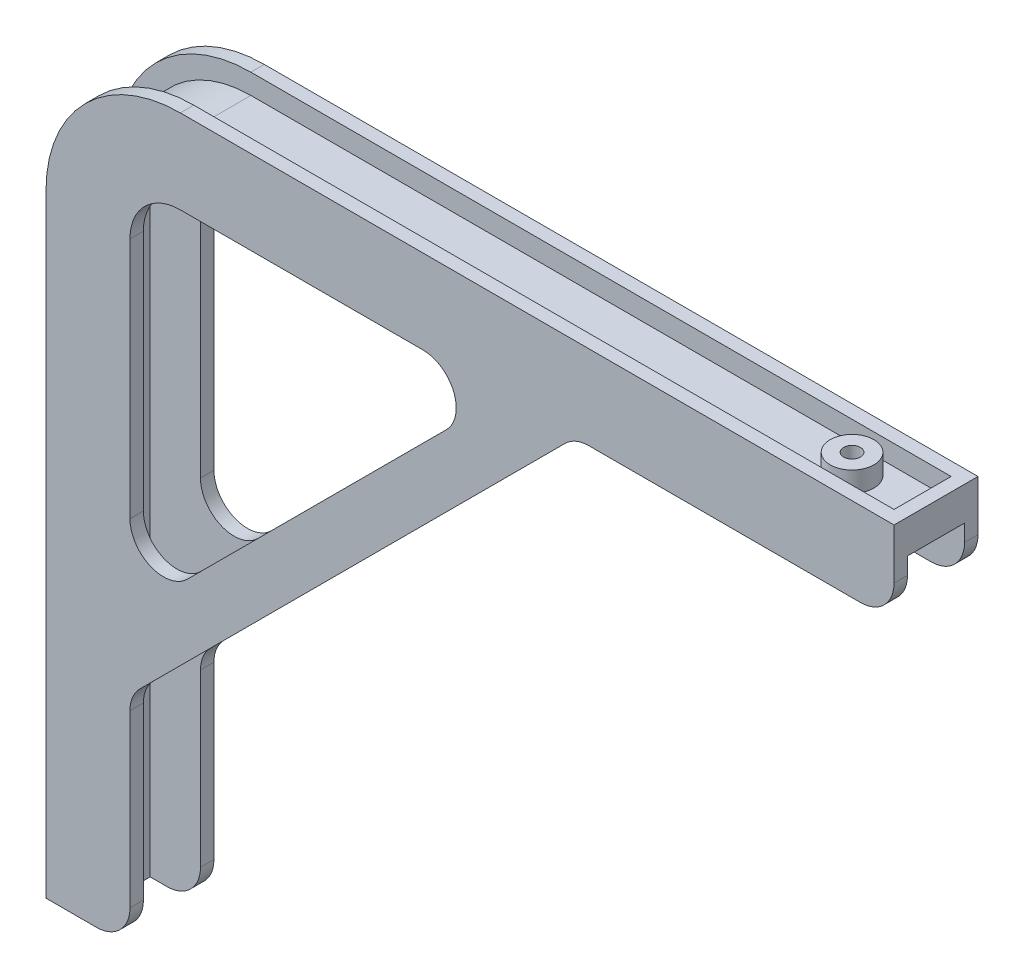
from build123d import *

# Parameters (mm, degrees)
EXTRUSION1_DEPTH        = 12.5
ESQUISSE2_R             = 3
ENL_V_MAT_EXTRU_1_DEPTH = 323.674371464
ESQUISSE3_R             = 2.5
ENL_V_MAT_EXTRU_2_DEPTH = 331.255582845
COQUE1_T                = -4
EXTRUSION2_DEPTH        = 4


with BuildPart() as part:
    # Esquisse1 → Extrusion1 (new, symmetric)
    with BuildSketch(Plane.XY):
        with BuildLine():
            Line((0, 0), (-212.5, 0))
            ThreePointArc((-212.5, 0), (-233.713203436, -8.786796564), (-242.5, -30))
            Line((-242.5, -30), (-242.5, -212.5))
            Line((-242.5, -212.5), (-252.5, -212.5))
            Line((-252.5, -212.5), (-252.5, -30))
            ThreePointArc((-252.5, -30), (-240.784271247, -1.715728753), (-212.5, 10))
            Line((-212.5, 10), (0, 10))
            Line((0, 10), (0, 0))
        make_face()
    extrude(amount=EXTRUSION1_DEPTH, both=True)

    # Esquisse2 → Enl_v. mat.-Extru.1 (cut, through all)
    with BuildSketch(Plane(origin=(-242.5, 0, 0), x_dir=(0, 0, -1), z_dir=(1, 0, 0))):
        with Locations(Location((0, -50, 0), (0, 0, 90))):
            Circle(ESQUISSE2_R)
        with Locations(Location((0, -175, 0), (0, 0, 90))):
            Circle(ESQUISSE2_R)
    extrude(amount=-ENL_V_MAT_EXTRU_1_DEPTH, mode=Mode.SUBTRACT)

    # Esquisse3 → Enl_v. mat.-Extru.2 (cut, through all)
    with BuildSketch(Plane.XZ):
        with Locations((-25, 0)):
            Circle(ESQUISSE3_R)
    extrude(amount=-ENL_V_MAT_EXTRU_2_DEPTH, mode=Mode.SUBTRACT)

    # Coque1
    coque1_openings = [part.faces().sort_by_distance(p)[0] for p in [
        (-252.5, -121.359810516, 0),
        (-240.784271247, -1.715728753, 0),
        (-106.551413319, 10, 0),
    ]]
    offset(amount=COQUE1_T, openings=coque1_openings, kind=Kind.INTERSECTION)

    # Esquisse4 → Extrusion2 (add)
    with BuildSketch(Plane.XY.offset(12.5)):
        with BuildLine():
            Line((-212.5, 0), (0, 0))
            Line((0, 0), (0, -5))
            ThreePointArc((0, -5), (-2.928932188, -12.071067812), (-10, -15))
            Line((-10, -15), (-90.857864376, -15))
            ThreePointArc((-90.857864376, -15), (-94.6846987, -15.761204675), (-97.928932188, -17.928932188))
            Line((-97.928932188, -17.928932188), (-224.571067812, -144.571067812))
            ThreePointArc((-224.571067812, -144.571067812), (-226.738795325, -147.8153013), (-227.5, -151.642135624))
            Line((-227.5, -151.642135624), (-227.5, -202.5))
            ThreePointArc((-227.5, -202.5), (-230.428932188, -209.571067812), (-237.5, -212.5))
            Line((-237.5, -212.5), (-242.5, -212.5))
            Line((-242.5, -212.5), (-242.5, -30))
            ThreePointArc((-242.5, -30), (-233.713203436, -8.786796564), (-212.5, 0))
        make_face()
        with BuildLine():
            Line((-212.5, -15), (-140.355339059, -15))
            ThreePointArc((-140.355339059, -15), (-131.116543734, -21.173165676), (-133.284271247, -32.071067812))
            Line((-133.284271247, -32.071067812), (-210.428932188, -109.215728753))
            ThreePointArc((-210.428932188, -109.215728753), (-221.326834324, -111.383456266), (-227.5, -102.144660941))
            Line((-227.5, -102.144660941), (-227.5, -30))
            ThreePointArc((-227.5, -30), (-223.106601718, -19.393398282), (-212.5, -15))
        make_face(mode=Mode.SUBTRACT)
    extrusion2 = extrude(amount=-EXTRUSION2_DEPTH)

    # Sym_trie1: Extrusion2 across plane
    add(extrusion2.mirror(Plane.XY))


solid = part.part
